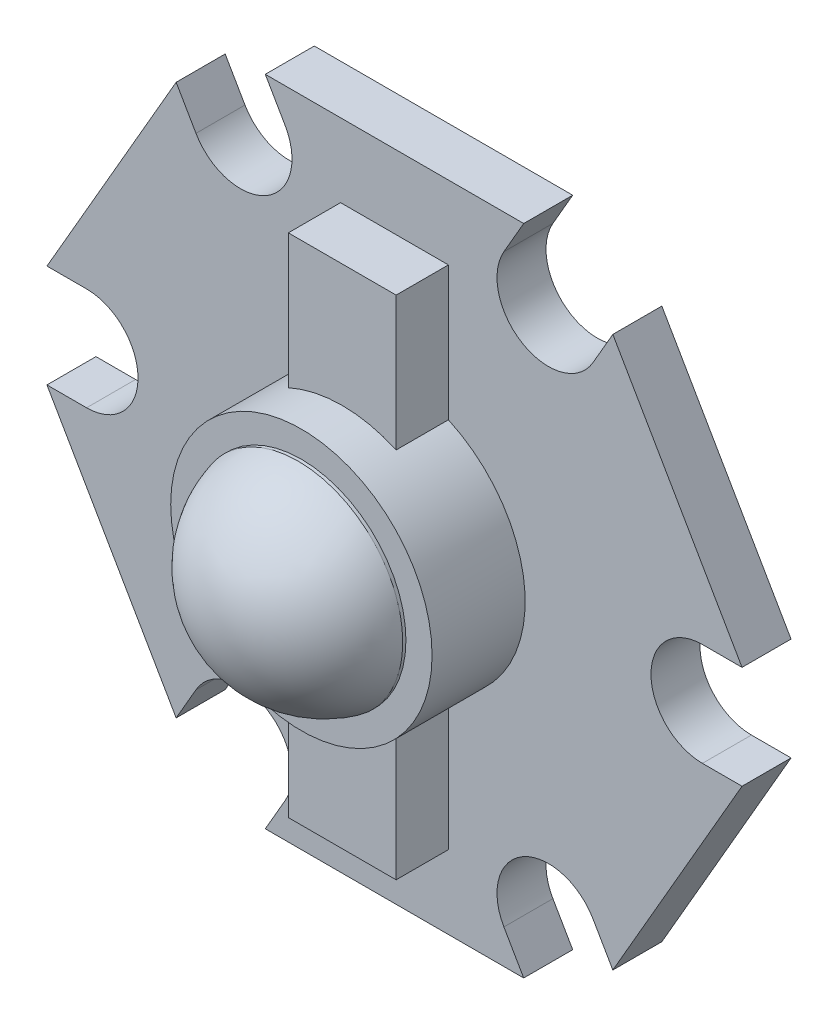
ISO-10303-21;
HEADER;
FILE_DESCRIPTION(('STEP AP214'),'2;1');
FILE_NAME('part.step','',(''),(''),'','','');
FILE_SCHEMA(('AUTOMOTIVE_DESIGN { 1 0 10303 214 1 1 1 1 }'));
ENDSEC;
DATA;
#1=APPLICATION_CONTEXT('core data for automotive mechanical design processes');
#2=APPLICATION_PROTOCOL_DEFINITION('international standard','automotive_design',2000,#1);
#3=PRODUCT_CONTEXT('',#1,'mechanical');
#4=PRODUCT('Part','Part','',(#3));
#5=PRODUCT_RELATED_PRODUCT_CATEGORY('part','',(#4));
#6=PRODUCT_DEFINITION_FORMATION('','',#4);
#7=PRODUCT_DEFINITION_CONTEXT('part definition',#1,'design');
#8=PRODUCT_DEFINITION('design','',#6,#7);
#9=PRODUCT_DEFINITION_SHAPE('','',#8);
#10=(LENGTH_UNIT() NAMED_UNIT(*) SI_UNIT(.MILLI.,.METRE.));
#11=(NAMED_UNIT(*) PLANE_ANGLE_UNIT() SI_UNIT($,.RADIAN.));
#12=(NAMED_UNIT(*) SI_UNIT($,.STERADIAN.) SOLID_ANGLE_UNIT());
#13=UNCERTAINTY_MEASURE_WITH_UNIT(LENGTH_MEASURE(1.E-05),#10,'distance_accuracy_value','');
#14=(GEOMETRIC_REPRESENTATION_CONTEXT(3) GLOBAL_UNCERTAINTY_ASSIGNED_CONTEXT((#13)) GLOBAL_UNIT_ASSIGNED_CONTEXT((#10,
#11,#12)) REPRESENTATION_CONTEXT('',''));
#15=CARTESIAN_POINT('',(0.,0.,0.));
#16=DIRECTION('',(0.,0.,1.));
#17=DIRECTION('',(1.,0.,0.));
#18=AXIS2_PLACEMENT_3D('',#15,#16,#17);
#19=CARTESIAN_POINT('',(0.,0.,3.652));
#20=DIRECTION('',(1.,0.,0.));
#21=DIRECTION('',(0.,0.,-1.));
#22=AXIS2_PLACEMENT_3D('',#19,#20,#21);
#23=SPHERICAL_SURFACE('',#22,3.298);
#24=CARTESIAN_POINT('',(0.,0.,4.45));
#25=DIRECTION('',(0.,0.,-1.));
#26=DIRECTION('',(-1.,0.,0.));
#27=AXIS2_PLACEMENT_3D('',#24,#25,#26);
#28=CIRCLE('',#27,3.2);
#29=CARTESIAN_POINT('',(-3.2,0.,4.45));
#30=VERTEX_POINT('',#29);
#31=EDGE_CURVE('E21',#30,#30,#28,.T.);
#32=ORIENTED_EDGE('',*,*,#31,.F.);
#33=EDGE_LOOP('',(#32));
#34=FACE_BOUND('',#33,.T.);
#35=ADVANCED_FACE('F17',(#34),#23,.T.);
#36=CARTESIAN_POINT('',(0.,0.,4.45));
#37=DIRECTION('',(0.,0.,-1.));
#38=DIRECTION('',(-1.,0.,0.));
#39=AXIS2_PLACEMENT_3D('',#36,#37,#38);
#40=CYLINDRICAL_SURFACE('',#39,3.2);
#41=CARTESIAN_POINT('',(0.,0.,4.35));
#42=DIRECTION('',(0.,0.,-1.));
#43=DIRECTION('',(-1.,0.,0.));
#44=AXIS2_PLACEMENT_3D('',#41,#42,#43);
#45=CIRCLE('',#44,3.2);
#46=CARTESIAN_POINT('',(-3.2,0.,4.35));
#47=VERTEX_POINT('',#46);
#48=EDGE_CURVE('E260',#47,#47,#45,.T.);
#49=ORIENTED_EDGE('',*,*,#48,.F.);
#50=EDGE_LOOP('',(#49));
#51=FACE_BOUND('',#50,.T.);
#52=ORIENTED_EDGE('',*,*,#31,.T.);
#53=EDGE_LOOP('',(#52));
#54=FACE_BOUND('',#53,.T.);
#55=ADVANCED_FACE('F268',(#51,#54),#40,.T.);
#56=CARTESIAN_POINT('',(0.,0.,3.1));
#57=DIRECTION('',(0.,0.,1.));
#58=DIRECTION('',(1.,0.,0.));
#59=AXIS2_PLACEMENT_3D('',#56,#57,#58);
#60=PLANE('',#59);
#61=DIRECTION('',(1.,0.,0.));
#62=VECTOR('',#61,1.);
#63=CARTESIAN_POINT('',(-1.65,7.75,3.1));
#64=LINE('',#63,#62);
#65=CARTESIAN_POINT('',(1.65,7.75,3.1));
#66=VERTEX_POINT('',#65);
#67=CARTESIAN_POINT('',(-1.65,7.75,3.1));
#68=VERTEX_POINT('',#67);
#69=EDGE_CURVE('E236',#66,#68,#64,.F.);
#70=ORIENTED_EDGE('',*,*,#69,.T.);
#71=DIRECTION('',(0.,1.,0.));
#72=VECTOR('',#71,1.);
#73=CARTESIAN_POINT('',(-1.65,7.75,3.1));
#74=LINE('',#73,#72);
#75=CARTESIAN_POINT('',(-1.65,3.64383040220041,3.1));
#76=VERTEX_POINT('',#75);
#77=EDGE_CURVE('E229',#68,#76,#74,.F.);
#78=ORIENTED_EDGE('',*,*,#77,.T.);
#79=CARTESIAN_POINT('',(0.,0.,3.1));
#80=DIRECTION('',(0.,0.,-1.));
#81=DIRECTION('',(-1.,0.,0.));
#82=AXIS2_PLACEMENT_3D('',#79,#80,#81);
#83=CIRCLE('',#82,4.);
#84=CARTESIAN_POINT('',(1.65,3.64383040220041,3.1));
#85=VERTEX_POINT('',#84);
#86=EDGE_CURVE('E233',#85,#76,#83,.F.);
#87=ORIENTED_EDGE('',*,*,#86,.F.);
#88=DIRECTION('',(0.,-1.,0.));
#89=VECTOR('',#88,1.);
#90=CARTESIAN_POINT('',(1.65,7.75,3.1));
#91=LINE('',#90,#89);
#92=EDGE_CURVE('E224',#85,#66,#91,.F.);
#93=ORIENTED_EDGE('',*,*,#92,.T.);
#94=EDGE_LOOP('',(#70,#78,#87,#93));
#95=FACE_BOUND('',#94,.T.);
#96=ADVANCED_FACE('F231',(#95),#60,.T.);
#97=CARTESIAN_POINT('',(0.,0.,4.35));
#98=DIRECTION('',(0.,0.,1.));
#99=DIRECTION('',(1.,0.,0.));
#100=AXIS2_PLACEMENT_3D('',#97,#98,#99);
#101=PLANE('',#100);
#102=ORIENTED_EDGE('',*,*,#48,.T.);
#103=EDGE_LOOP('',(#102));
#104=FACE_BOUND('',#103,.T.);
#105=CARTESIAN_POINT('',(0.,0.,4.35));
#106=DIRECTION('',(0.,0.,-1.));
#107=DIRECTION('',(-1.,0.,0.));
#108=AXIS2_PLACEMENT_3D('',#105,#106,#107);
#109=CIRCLE('',#108,4.);
#110=CARTESIAN_POINT('',(-4.,0.,4.35));
#111=VERTEX_POINT('',#110);
#112=EDGE_CURVE('E250',#111,#111,#109,.T.);
#113=ORIENTED_EDGE('',*,*,#112,.F.);
#114=EDGE_LOOP('',(#113));
#115=FACE_BOUND('',#114,.T.);
#116=ADVANCED_FACE('F409',(#104,#115),#101,.T.);
#117=CARTESIAN_POINT('',(0.,0.,3.1));
#118=DIRECTION('',(0.,0.,1.));
#119=DIRECTION('',(1.,0.,0.));
#120=AXIS2_PLACEMENT_3D('',#117,#118,#119);
#121=PLANE('',#120);
#122=DIRECTION('',(0.,1.,0.));
#123=VECTOR('',#122,1.);
#124=CARTESIAN_POINT('',(-1.65,-3.64383040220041,3.1));
#125=LINE('',#124,#123);
#126=CARTESIAN_POINT('',(-1.65,-3.64383040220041,3.1));
#127=VERTEX_POINT('',#126);
#128=CARTESIAN_POINT('',(-1.65,-7.75,3.1));
#129=VERTEX_POINT('',#128);
#130=EDGE_CURVE('E731',#127,#129,#125,.F.);
#131=ORIENTED_EDGE('',*,*,#130,.T.);
#132=DIRECTION('',(1.,0.,0.));
#133=VECTOR('',#132,1.);
#134=CARTESIAN_POINT('',(-1.65,-7.75,3.1));
#135=LINE('',#134,#133);
#136=CARTESIAN_POINT('',(1.65,-7.75,3.1));
#137=VERTEX_POINT('',#136);
#138=EDGE_CURVE('E812',#129,#137,#135,.T.);
#139=ORIENTED_EDGE('',*,*,#138,.T.);
#140=DIRECTION('',(0.,-1.,0.));
#141=VECTOR('',#140,1.);
#142=CARTESIAN_POINT('',(1.65,-3.64383040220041,3.1));
#143=LINE('',#142,#141);
#144=CARTESIAN_POINT('',(1.65,-3.64383040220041,3.1));
#145=VERTEX_POINT('',#144);
#146=EDGE_CURVE('E806',#137,#145,#143,.F.);
#147=ORIENTED_EDGE('',*,*,#146,.T.);
#148=CARTESIAN_POINT('',(0.,0.,3.1));
#149=DIRECTION('',(0.,0.,-1.));
#150=DIRECTION('',(-1.,0.,0.));
#151=AXIS2_PLACEMENT_3D('',#148,#149,#150);
#152=CIRCLE('',#151,4.);
#153=EDGE_CURVE('E729',#127,#145,#152,.F.);
#154=ORIENTED_EDGE('',*,*,#153,.F.);
#155=EDGE_LOOP('',(#131,#139,#147,#154));
#156=FACE_BOUND('',#155,.T.);
#157=ADVANCED_FACE('F406',(#156),#121,.T.);
#158=CARTESIAN_POINT('',(1.65,7.75,3.1));
#159=DIRECTION('',(-1.,0.,0.));
#160=DIRECTION('',(0.,-1.,0.));
#161=AXIS2_PLACEMENT_3D('',#158,#159,#160);
#162=PLANE('',#161);
#163=DIRECTION('',(0.,1.,0.));
#164=VECTOR('',#163,1.);
#165=CARTESIAN_POINT('',(1.65,8.16228943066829,1.5));
#166=LINE('',#165,#164);
#167=CARTESIAN_POINT('',(1.65,3.64383040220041,1.5));
#168=VERTEX_POINT('',#167);
#169=CARTESIAN_POINT('',(1.65,7.75,1.5));
#170=VERTEX_POINT('',#169);
#171=EDGE_CURVE('E739',#168,#170,#166,.T.);
#172=ORIENTED_EDGE('',*,*,#171,.T.);
#173=DIRECTION('',(0.,0.,1.));
#174=VECTOR('',#173,1.);
#175=CARTESIAN_POINT('',(1.65,7.75,3.1));
#176=LINE('',#175,#174);
#177=EDGE_CURVE('E241',#170,#66,#176,.T.);
#178=ORIENTED_EDGE('',*,*,#177,.T.);
#179=ORIENTED_EDGE('',*,*,#92,.F.);
#180=DIRECTION('',(0.,0.,-1.));
#181=VECTOR('',#180,1.);
#182=CARTESIAN_POINT('',(1.65,3.64383040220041,4.35));
#183=LINE('',#182,#181);
#184=EDGE_CURVE('E255',#168,#85,#183,.F.);
#185=ORIENTED_EDGE('',*,*,#184,.F.);
#186=EDGE_LOOP('',(#172,#178,#179,#185));
#187=FACE_BOUND('',#186,.T.);
#188=ADVANCED_FACE('F402',(#187),#162,.F.);
#189=CARTESIAN_POINT('',(-1.65,7.75,3.1));
#190=DIRECTION('',(0.,-1.,0.));
#191=DIRECTION('',(1.,0.,0.));
#192=AXIS2_PLACEMENT_3D('',#189,#190,#191);
#193=PLANE('',#192);
#194=DIRECTION('',(-1.,0.,0.));
#195=VECTOR('',#194,1.);
#196=CARTESIAN_POINT('',(-4.71250000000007,7.75,1.5));
#197=LINE('',#196,#195);
#198=CARTESIAN_POINT('',(-1.65,7.75,1.5));
#199=VERTEX_POINT('',#198);
#200=EDGE_CURVE('E819',#170,#199,#197,.T.);
#201=ORIENTED_EDGE('',*,*,#200,.T.);
#202=DIRECTION('',(0.,0.,1.));
#203=VECTOR('',#202,1.);
#204=CARTESIAN_POINT('',(-1.65,7.75,3.1));
#205=LINE('',#204,#203);
#206=EDGE_CURVE('E240',#199,#68,#205,.T.);
#207=ORIENTED_EDGE('',*,*,#206,.T.);
#208=ORIENTED_EDGE('',*,*,#69,.F.);
#209=ORIENTED_EDGE('',*,*,#177,.F.);
#210=EDGE_LOOP('',(#201,#207,#208,#209));
#211=FACE_BOUND('',#210,.T.);
#212=ADVANCED_FACE('F399',(#211),#193,.F.);
#213=CARTESIAN_POINT('',(-1.65,7.75,3.1));
#214=DIRECTION('',(1.,0.,0.));
#215=DIRECTION('',(0.,1.,0.));
#216=AXIS2_PLACEMENT_3D('',#213,#214,#215);
#217=PLANE('',#216);
#218=DIRECTION('',(0.,1.,0.));
#219=VECTOR('',#218,1.);
#220=CARTESIAN_POINT('',(-1.65,8.16228943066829,1.5));
#221=LINE('',#220,#219);
#222=CARTESIAN_POINT('',(-1.65,3.64383040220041,1.5));
#223=VERTEX_POINT('',#222);
#224=EDGE_CURVE('E248',#199,#223,#221,.F.);
#225=ORIENTED_EDGE('',*,*,#224,.T.);
#226=DIRECTION('',(0.,0.,-1.));
#227=VECTOR('',#226,1.);
#228=CARTESIAN_POINT('',(-1.65,3.64383040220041,4.35));
#229=LINE('',#228,#227);
#230=EDGE_CURVE('E245',#76,#223,#229,.T.);
#231=ORIENTED_EDGE('',*,*,#230,.F.);
#232=ORIENTED_EDGE('',*,*,#77,.F.);
#233=ORIENTED_EDGE('',*,*,#206,.F.);
#234=EDGE_LOOP('',(#225,#231,#232,#233));
#235=FACE_BOUND('',#234,.T.);
#236=ADVANCED_FACE('F246',(#235),#217,.F.);
#237=CARTESIAN_POINT('',(0.,0.,4.35));
#238=DIRECTION('',(0.,0.,-1.));
#239=DIRECTION('',(-1.,0.,0.));
#240=AXIS2_PLACEMENT_3D('',#237,#238,#239);
#241=CYLINDRICAL_SURFACE('',#240,4.);
#242=ORIENTED_EDGE('',*,*,#112,.T.);
#243=EDGE_LOOP('',(#242));
#244=FACE_BOUND('',#243,.T.);
#245=DIRECTION('',(0.,0.,1.));
#246=VECTOR('',#245,1.);
#247=CARTESIAN_POINT('',(1.65,-3.64383040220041,3.1));
#248=LINE('',#247,#246);
#249=CARTESIAN_POINT('',(1.65,-3.64383040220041,1.5));
#250=VERTEX_POINT('',#249);
#251=EDGE_CURVE('E808',#145,#250,#248,.F.);
#252=ORIENTED_EDGE('',*,*,#251,.T.);
#253=CARTESIAN_POINT('',(0.,0.,1.5));
#254=DIRECTION('',(0.,0.,-1.));
#255=DIRECTION('',(-1.,0.,0.));
#256=AXIS2_PLACEMENT_3D('',#253,#254,#255);
#257=CIRCLE('',#256,4.);
#258=EDGE_CURVE('E737',#250,#168,#257,.F.);
#259=ORIENTED_EDGE('',*,*,#258,.T.);
#260=ORIENTED_EDGE('',*,*,#184,.T.);
#261=ORIENTED_EDGE('',*,*,#86,.T.);
#262=ORIENTED_EDGE('',*,*,#230,.T.);
#263=CARTESIAN_POINT('',(0.,0.,1.5));
#264=DIRECTION('',(0.,0.,-1.));
#265=DIRECTION('',(-1.,0.,0.));
#266=AXIS2_PLACEMENT_3D('',#263,#264,#265);
#267=CIRCLE('',#266,4.);
#268=CARTESIAN_POINT('',(-1.65,-3.64383040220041,1.5));
#269=VERTEX_POINT('',#268);
#270=EDGE_CURVE('E741',#223,#269,#267,.F.);
#271=ORIENTED_EDGE('',*,*,#270,.T.);
#272=DIRECTION('',(0.,0.,1.));
#273=VECTOR('',#272,1.);
#274=CARTESIAN_POINT('',(-1.65,-3.64383040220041,3.1));
#275=LINE('',#274,#273);
#276=EDGE_CURVE('E734',#269,#127,#275,.T.);
#277=ORIENTED_EDGE('',*,*,#276,.T.);
#278=ORIENTED_EDGE('',*,*,#153,.T.);
#279=EDGE_LOOP('',(#252,#259,#260,#261,#262,#271,#277,#278));
#280=FACE_BOUND('',#279,.T.);
#281=ADVANCED_FACE('F253',(#244,#280),#241,.T.);
#282=CARTESIAN_POINT('',(-1.65,-3.64383040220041,3.1));
#283=DIRECTION('',(1.,0.,0.));
#284=DIRECTION('',(0.,1.,0.));
#285=AXIS2_PLACEMENT_3D('',#282,#283,#284);
#286=PLANE('',#285);
#287=DIRECTION('',(0.,1.,0.));
#288=VECTOR('',#287,1.);
#289=CARTESIAN_POINT('',(-1.65,8.16228943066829,1.5));
#290=LINE('',#289,#288);
#291=CARTESIAN_POINT('',(-1.65,-7.75,1.5));
#292=VERTEX_POINT('',#291);
#293=EDGE_CURVE('E743',#269,#292,#290,.F.);
#294=ORIENTED_EDGE('',*,*,#293,.T.);
#295=DIRECTION('',(0.,0.,1.));
#296=VECTOR('',#295,1.);
#297=CARTESIAN_POINT('',(-1.65,-7.75,3.1));
#298=LINE('',#297,#296);
#299=EDGE_CURVE('E809',#292,#129,#298,.T.);
#300=ORIENTED_EDGE('',*,*,#299,.T.);
#301=ORIENTED_EDGE('',*,*,#130,.F.);
#302=ORIENTED_EDGE('',*,*,#276,.F.);
#303=EDGE_LOOP('',(#294,#300,#301,#302));
#304=FACE_BOUND('',#303,.T.);
#305=ADVANCED_FACE('F389',(#304),#286,.F.);
#306=CARTESIAN_POINT('',(-1.65,-7.75,3.1));
#307=DIRECTION('',(0.,1.,0.));
#308=DIRECTION('',(0.,0.,1.));
#309=AXIS2_PLACEMENT_3D('',#306,#307,#308);
#310=PLANE('',#309);
#311=DIRECTION('',(-1.,0.,0.));
#312=VECTOR('',#311,1.);
#313=CARTESIAN_POINT('',(-4.71250000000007,-7.75,1.5));
#314=LINE('',#313,#312);
#315=CARTESIAN_POINT('',(1.65,-7.75,1.5));
#316=VERTEX_POINT('',#315);
#317=EDGE_CURVE('E831',#292,#316,#314,.F.);
#318=ORIENTED_EDGE('',*,*,#317,.T.);
#319=DIRECTION('',(0.,0.,1.));
#320=VECTOR('',#319,1.);
#321=CARTESIAN_POINT('',(1.65,-7.75,3.1));
#322=LINE('',#321,#320);
#323=EDGE_CURVE('E740',#316,#137,#322,.T.);
#324=ORIENTED_EDGE('',*,*,#323,.T.);
#325=ORIENTED_EDGE('',*,*,#138,.F.);
#326=ORIENTED_EDGE('',*,*,#299,.F.);
#327=EDGE_LOOP('',(#318,#324,#325,#326));
#328=FACE_BOUND('',#327,.T.);
#329=ADVANCED_FACE('F385',(#328),#310,.F.);
#330=CARTESIAN_POINT('',(1.65,-3.64383040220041,3.1));
#331=DIRECTION('',(-1.,0.,0.));
#332=DIRECTION('',(0.,-1.,0.));
#333=AXIS2_PLACEMENT_3D('',#330,#331,#332);
#334=PLANE('',#333);
#335=DIRECTION('',(0.,1.,0.));
#336=VECTOR('',#335,1.);
#337=CARTESIAN_POINT('',(1.65,8.16228943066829,1.5));
#338=LINE('',#337,#336);
#339=EDGE_CURVE('E833',#316,#250,#338,.T.);
#340=ORIENTED_EDGE('',*,*,#339,.T.);
#341=ORIENTED_EDGE('',*,*,#251,.F.);
#342=ORIENTED_EDGE('',*,*,#146,.F.);
#343=ORIENTED_EDGE('',*,*,#323,.F.);
#344=EDGE_LOOP('',(#340,#341,#342,#343));
#345=FACE_BOUND('',#344,.T.);
#346=ADVANCED_FACE('F381',(#345),#334,.F.);
#347=CARTESIAN_POINT('',(-4.71250000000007,8.16228943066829,1.5));
#348=DIRECTION('',(0.,0.,-1.));
#349=DIRECTION('',(-1.,0.,0.));
#350=AXIS2_PLACEMENT_3D('',#347,#348,#349);
#351=PLANE('',#350);
#352=ORIENTED_EDGE('',*,*,#317,.F.);
#353=ORIENTED_EDGE('',*,*,#293,.F.);
#354=ORIENTED_EDGE('',*,*,#270,.F.);
#355=ORIENTED_EDGE('',*,*,#224,.F.);
#356=ORIENTED_EDGE('',*,*,#200,.F.);
#357=ORIENTED_EDGE('',*,*,#171,.F.);
#358=ORIENTED_EDGE('',*,*,#258,.F.);
#359=ORIENTED_EDGE('',*,*,#339,.F.);
#360=EDGE_LOOP('',(#352,#353,#354,#355,#356,#357,#358,#359));
#361=FACE_BOUND('',#360,.T.);
#362=DIRECTION('',(1.,0.,0.));
#363=VECTOR('',#362,1.);
#364=CARTESIAN_POINT('',(-3.95484934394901,10.,1.5));
#365=LINE('',#364,#363);
#366=CARTESIAN_POINT('',(3.95484934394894,10.,1.5));
#367=VERTEX_POINT('',#366);
#368=CARTESIAN_POINT('',(-3.95484934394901,10.,1.5));
#369=VERTEX_POINT('',#368);
#370=EDGE_CURVE('E927',#367,#369,#365,.F.);
#371=ORIENTED_EDGE('',*,*,#370,.T.);
#372=DIRECTION('',(-0.500000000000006,0.866025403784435,0.));
#373=VECTOR('',#372,1.);
#374=CARTESIAN_POINT('',(-3.34850998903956,8.94978943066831,1.5));
#375=LINE('',#374,#373);
#376=CARTESIAN_POINT('',(-3.34850998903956,8.94978943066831,1.5));
#377=VERTEX_POINT('',#376);
#378=EDGE_CURVE('E932',#369,#377,#375,.F.);
#379=ORIENTED_EDGE('',*,*,#378,.T.);
#380=CARTESIAN_POINT('',(-4.71250000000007,8.16228943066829,1.5));
#381=DIRECTION('',(0.,0.,-1.));
#382=DIRECTION('',(-1.,0.,0.));
#383=AXIS2_PLACEMENT_3D('',#380,#381,#382);
#384=CIRCLE('',#383,1.575);
#385=CARTESIAN_POINT('',(-6.07649001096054,7.37478943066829,1.5));
#386=VERTEX_POINT('',#385);
#387=EDGE_CURVE('E764',#377,#386,#384,.T.);
#388=ORIENTED_EDGE('',*,*,#387,.T.);
#389=DIRECTION('',(0.500000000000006,-0.866025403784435,0.));
#390=VECTOR('',#389,1.);
#391=CARTESIAN_POINT('',(-6.07649001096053,7.3747894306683,1.5));
#392=LINE('',#391,#390);
#393=CARTESIAN_POINT('',(-6.68282936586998,8.42499999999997,1.5));
#394=VERTEX_POINT('',#393);
#395=EDGE_CURVE('E906',#386,#394,#392,.F.);
#396=ORIENTED_EDGE('',*,*,#395,.T.);
#397=DIRECTION('',(0.499999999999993,0.866025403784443,0.));
#398=VECTOR('',#397,1.);
#399=CARTESIAN_POINT('',(-6.68282936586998,8.42499999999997,1.5));
#400=LINE('',#399,#398);
#401=CARTESIAN_POINT('',(-10.6376787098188,1.57500000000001,1.5));
#402=VERTEX_POINT('',#401);
#403=EDGE_CURVE('E901',#394,#402,#400,.F.);
#404=ORIENTED_EDGE('',*,*,#403,.T.);
#405=DIRECTION('',(-1.,0.,0.));
#406=VECTOR('',#405,1.);
#407=CARTESIAN_POINT('',(-9.42499999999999,1.575,1.5));
#408=LINE('',#407,#406);
#409=CARTESIAN_POINT('',(-9.42499999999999,1.575,1.5));
#410=VERTEX_POINT('',#409);
#411=EDGE_CURVE('E896',#402,#410,#408,.F.);
#412=ORIENTED_EDGE('',*,*,#411,.T.);
#413=CARTESIAN_POINT('',(-9.425,0.,1.5));
#414=DIRECTION('',(0.,0.,-1.));
#415=DIRECTION('',(-1.,0.,0.));
#416=AXIS2_PLACEMENT_3D('',#413,#414,#415);
#417=CIRCLE('',#416,1.575);
#418=CARTESIAN_POINT('',(-9.425,-1.57499999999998,1.5));
#419=VERTEX_POINT('',#418);
#420=EDGE_CURVE('E760',#410,#419,#417,.T.);
#421=ORIENTED_EDGE('',*,*,#420,.T.);
#422=DIRECTION('',(1.,0.,0.));
#423=VECTOR('',#422,1.);
#424=CARTESIAN_POINT('',(-9.425,-1.57499999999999,1.5));
#425=LINE('',#424,#423);
#426=CARTESIAN_POINT('',(-10.6376787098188,-1.57499999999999,1.5));
#427=VERTEX_POINT('',#426);
#428=EDGE_CURVE('E892',#419,#427,#425,.F.);
#429=ORIENTED_EDGE('',*,*,#428,.T.);
#430=DIRECTION('',(-0.499999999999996,0.866025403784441,0.));
#431=VECTOR('',#430,1.);
#432=CARTESIAN_POINT('',(-6.68282936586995,-8.42499999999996,1.5));
#433=LINE('',#432,#431);
#434=CARTESIAN_POINT('',(-6.68282936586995,-8.42499999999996,1.5));
#435=VERTEX_POINT('',#434);
#436=EDGE_CURVE('E887',#427,#435,#433,.F.);
#437=ORIENTED_EDGE('',*,*,#436,.T.);
#438=DIRECTION('',(-0.500000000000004,-0.866025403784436,0.));
#439=VECTOR('',#438,1.);
#440=CARTESIAN_POINT('',(-6.07649001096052,-7.3747894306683,1.5));
#441=LINE('',#440,#439);
#442=CARTESIAN_POINT('',(-6.07649001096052,-7.3747894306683,1.5));
#443=VERTEX_POINT('',#442);
#444=EDGE_CURVE('E882',#435,#443,#441,.F.);
#445=ORIENTED_EDGE('',*,*,#444,.T.);
#446=CARTESIAN_POINT('',(-4.71250000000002,-8.16228943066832,1.5));
#447=DIRECTION('',(0.,0.,-1.));
#448=DIRECTION('',(-1.,0.,0.));
#449=AXIS2_PLACEMENT_3D('',#446,#447,#448);
#450=CIRCLE('',#449,1.575);
#451=CARTESIAN_POINT('',(-3.34850998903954,-8.94978943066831,1.5));
#452=VERTEX_POINT('',#451);
#453=EDGE_CURVE('E756',#443,#452,#450,.T.);
#454=ORIENTED_EDGE('',*,*,#453,.T.);
#455=DIRECTION('',(0.500000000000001,0.866025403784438,0.));
#456=VECTOR('',#455,1.);
#457=CARTESIAN_POINT('',(-3.34850998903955,-8.94978943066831,1.5));
#458=LINE('',#457,#456);
#459=CARTESIAN_POINT('',(-3.95484934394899,-10.,1.5));
#460=VERTEX_POINT('',#459);
#461=EDGE_CURVE('E878',#452,#460,#458,.F.);
#462=ORIENTED_EDGE('',*,*,#461,.T.);
#463=DIRECTION('',(1.,0.,0.));
#464=VECTOR('',#463,1.);
#465=CARTESIAN_POINT('',(-3.95484934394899,-10.,1.5));
#466=LINE('',#465,#464);
#467=CARTESIAN_POINT('',(3.95484934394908,-10.,1.5));
#468=VERTEX_POINT('',#467);
#469=EDGE_CURVE('E873',#460,#468,#466,.T.);
#470=ORIENTED_EDGE('',*,*,#469,.T.);
#471=DIRECTION('',(0.500000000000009,-0.866025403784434,0.));
#472=VECTOR('',#471,1.);
#473=CARTESIAN_POINT('',(3.34850998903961,-8.94978943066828,1.5));
#474=LINE('',#473,#472);
#475=CARTESIAN_POINT('',(3.34850998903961,-8.94978943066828,1.5));
#476=VERTEX_POINT('',#475);
#477=EDGE_CURVE('E754',#468,#476,#474,.F.);
#478=ORIENTED_EDGE('',*,*,#477,.T.);
#479=CARTESIAN_POINT('',(4.71250000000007,-8.16228943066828,1.5));
#480=DIRECTION('',(0.,0.,-1.));
#481=DIRECTION('',(-1.,0.,0.));
#482=AXIS2_PLACEMENT_3D('',#479,#480,#481);
#483=CIRCLE('',#482,1.575);
#484=CARTESIAN_POINT('',(6.07649001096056,-7.37478943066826,1.5));
#485=VERTEX_POINT('',#484);
#486=EDGE_CURVE('E752',#476,#485,#483,.T.);
#487=ORIENTED_EDGE('',*,*,#486,.T.);
#488=DIRECTION('',(-0.500000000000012,0.866025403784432,0.));
#489=VECTOR('',#488,1.);
#490=CARTESIAN_POINT('',(6.07649001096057,-7.37478943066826,1.5));
#491=LINE('',#490,#489);
#492=CARTESIAN_POINT('',(6.68282936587,-8.42499999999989,1.5));
#493=VERTEX_POINT('',#492);
#494=EDGE_CURVE('E864',#485,#493,#491,.F.);
#495=ORIENTED_EDGE('',*,*,#494,.T.);
#496=DIRECTION('',(-0.499999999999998,-0.86602540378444,0.));
#497=VECTOR('',#496,1.);
#498=CARTESIAN_POINT('',(6.68282936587,-8.42499999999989,1.5));
#499=LINE('',#498,#497);
#500=CARTESIAN_POINT('',(10.6376787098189,-1.57499999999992,1.5));
#501=VERTEX_POINT('',#500);
#502=EDGE_CURVE('E859',#493,#501,#499,.F.);
#503=ORIENTED_EDGE('',*,*,#502,.T.);
#504=DIRECTION('',(1.,0.,0.));
#505=VECTOR('',#504,1.);
#506=CARTESIAN_POINT('',(9.42500000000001,-1.57499999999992,1.5));
#507=LINE('',#506,#505);
#508=CARTESIAN_POINT('',(9.42500000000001,-1.57499999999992,1.5));
#509=VERTEX_POINT('',#508);
#510=EDGE_CURVE('E750',#501,#509,#507,.F.);
#511=ORIENTED_EDGE('',*,*,#510,.T.);
#512=CARTESIAN_POINT('',(9.425,0.,1.5));
#513=DIRECTION('',(0.,0.,-1.));
#514=DIRECTION('',(-1.,0.,0.));
#515=AXIS2_PLACEMENT_3D('',#512,#513,#514);
#516=CIRCLE('',#515,1.575);
#517=CARTESIAN_POINT('',(9.42500000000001,1.57500000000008,1.5));
#518=VERTEX_POINT('',#517);
#519=EDGE_CURVE('E748',#509,#518,#516,.T.);
#520=ORIENTED_EDGE('',*,*,#519,.T.);
#521=DIRECTION('',(-1.,0.,0.));
#522=VECTOR('',#521,1.);
#523=CARTESIAN_POINT('',(9.42499999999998,1.57500000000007,1.5));
#524=LINE('',#523,#522);
#525=CARTESIAN_POINT('',(10.6376787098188,1.57500000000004,1.5));
#526=VERTEX_POINT('',#525);
#527=EDGE_CURVE('E850',#518,#526,#524,.F.);
#528=ORIENTED_EDGE('',*,*,#527,.T.);
#529=DIRECTION('',(0.499999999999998,-0.86602540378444,0.));
#530=VECTOR('',#529,1.);
#531=CARTESIAN_POINT('',(6.68282936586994,8.425,1.5));
#532=LINE('',#531,#530);
#533=CARTESIAN_POINT('',(6.68282936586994,8.425,1.5));
#534=VERTEX_POINT('',#533);
#535=EDGE_CURVE('E845',#526,#534,#532,.F.);
#536=ORIENTED_EDGE('',*,*,#535,.T.);
#537=DIRECTION('',(0.499999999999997,0.86602540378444,0.));
#538=VECTOR('',#537,1.);
#539=CARTESIAN_POINT('',(6.07649001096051,7.37478943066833,1.5));
#540=LINE('',#539,#538);
#541=CARTESIAN_POINT('',(6.07649001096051,7.37478943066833,1.5));
#542=VERTEX_POINT('',#541);
#543=EDGE_CURVE('E746',#534,#542,#540,.F.);
#544=ORIENTED_EDGE('',*,*,#543,.T.);
#545=CARTESIAN_POINT('',(4.71250000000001,8.16228943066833,1.5));
#546=DIRECTION('',(0.,0.,-1.));
#547=DIRECTION('',(-1.,0.,0.));
#548=AXIS2_PLACEMENT_3D('',#545,#546,#547);
#549=CIRCLE('',#548,1.57500000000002);
#550=CARTESIAN_POINT('',(3.34850998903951,8.94978943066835,1.5));
#551=VERTEX_POINT('',#550);
#552=EDGE_CURVE('E744',#542,#551,#549,.T.);
#553=ORIENTED_EDGE('',*,*,#552,.T.);
#554=DIRECTION('',(-0.500000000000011,-0.866025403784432,0.));
#555=VECTOR('',#554,1.);
#556=CARTESIAN_POINT('',(3.3485099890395,8.94978943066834,1.5));
#557=LINE('',#556,#555);
#558=EDGE_CURVE('E910',#551,#367,#557,.F.);
#559=ORIENTED_EDGE('',*,*,#558,.T.);
#560=EDGE_LOOP('',(#371,#379,#388,#396,#404,#412,#421,#429,#437,#445,#454,#462,#470,#478,#487,
#495,#503,#511,#520,#528,#536,#544,#553,#559));
#561=FACE_BOUND('',#560,.T.);
#562=ADVANCED_FACE('F377',(#361,#561),#351,.F.);
#563=CARTESIAN_POINT('',(3.3485099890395,8.94978943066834,1.5));
#564=DIRECTION('',(-0.866025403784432,0.500000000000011,0.));
#565=DIRECTION('',(-0.500000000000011,-0.866025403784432,0.));
#566=AXIS2_PLACEMENT_3D('',#563,#564,#565);
#567=PLANE('',#566);
#568=DIRECTION('',(0.,0.,1.));
#569=VECTOR('',#568,1.);
#570=CARTESIAN_POINT('',(3.95484934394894,10.,1.5));
#571=LINE('',#570,#569);
#572=CARTESIAN_POINT('',(3.95484934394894,10.,0.));
#573=VERTEX_POINT('',#572);
#574=EDGE_CURVE('E929',#573,#367,#571,.T.);
#575=ORIENTED_EDGE('',*,*,#574,.T.);
#576=ORIENTED_EDGE('',*,*,#558,.F.);
#577=DIRECTION('',(0.,0.,-1.));
#578=VECTOR('',#577,1.);
#579=CARTESIAN_POINT('',(3.3485099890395,8.94978943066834,1.5));
#580=LINE('',#579,#578);
#581=CARTESIAN_POINT('',(3.34850998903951,8.94978943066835,0.));
#582=VERTEX_POINT('',#581);
#583=EDGE_CURVE('E747',#551,#582,#580,.T.);
#584=ORIENTED_EDGE('',*,*,#583,.T.);
#585=DIRECTION('',(-0.50000000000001,-0.866025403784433,0.));
#586=VECTOR('',#585,1.);
#587=CARTESIAN_POINT('',(3.95484934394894,10.,0.));
#588=LINE('',#587,#586);
#589=EDGE_CURVE('E771',#573,#582,#588,.T.);
#590=ORIENTED_EDGE('',*,*,#589,.F.);
#591=EDGE_LOOP('',(#575,#576,#584,#590));
#592=FACE_BOUND('',#591,.T.);
#593=ADVANCED_FACE('F373',(#592),#567,.F.);
#594=CARTESIAN_POINT('',(4.71250000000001,8.16228943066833,1.5));
#595=DIRECTION('',(0.,0.,-1.));
#596=DIRECTION('',(-1.,0.,0.));
#597=AXIS2_PLACEMENT_3D('',#594,#595,#596);
#598=CYLINDRICAL_SURFACE('',#597,1.57500000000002);
#599=ORIENTED_EDGE('',*,*,#552,.F.);
#600=DIRECTION('',(0.,0.,1.));
#601=VECTOR('',#600,1.);
#602=CARTESIAN_POINT('',(6.07649001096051,7.37478943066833,1.5));
#603=LINE('',#602,#601);
#604=CARTESIAN_POINT('',(6.07649001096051,7.37478943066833,0.));
#605=VERTEX_POINT('',#604);
#606=EDGE_CURVE('E842',#542,#605,#603,.F.);
#607=ORIENTED_EDGE('',*,*,#606,.T.);
#608=CARTESIAN_POINT('',(4.71250000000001,8.16228943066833,0.));
#609=DIRECTION('',(0.,0.,-1.));
#610=DIRECTION('',(-1.,0.,0.));
#611=AXIS2_PLACEMENT_3D('',#608,#609,#610);
#612=CIRCLE('',#611,1.57500000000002);
#613=EDGE_CURVE('E768',#582,#605,#612,.F.);
#614=ORIENTED_EDGE('',*,*,#613,.F.);
#615=ORIENTED_EDGE('',*,*,#583,.F.);
#616=EDGE_LOOP('',(#599,#607,#614,#615));
#617=FACE_BOUND('',#616,.T.);
#618=ADVANCED_FACE('F369',(#617),#598,.F.);
#619=CARTESIAN_POINT('',(6.07649001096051,7.37478943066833,1.5));
#620=DIRECTION('',(0.86602540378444,-0.499999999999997,0.));
#621=DIRECTION('',(0.499999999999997,0.86602540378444,0.));
#622=AXIS2_PLACEMENT_3D('',#619,#620,#621);
#623=PLANE('',#622);
#624=ORIENTED_EDGE('',*,*,#606,.F.);
#625=ORIENTED_EDGE('',*,*,#543,.F.);
#626=DIRECTION('',(0.,0.,1.));
#627=VECTOR('',#626,1.);
#628=CARTESIAN_POINT('',(6.68282936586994,8.425,1.5));
#629=LINE('',#628,#627);
#630=CARTESIAN_POINT('',(6.68282936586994,8.425,0.));
#631=VERTEX_POINT('',#630);
#632=EDGE_CURVE('E847',#534,#631,#629,.F.);
#633=ORIENTED_EDGE('',*,*,#632,.T.);
#634=DIRECTION('',(0.499999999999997,0.86602540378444,0.));
#635=VECTOR('',#634,1.);
#636=CARTESIAN_POINT('',(6.07649001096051,7.37478943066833,0.));
#637=LINE('',#636,#635);
#638=EDGE_CURVE('E770',#605,#631,#637,.T.);
#639=ORIENTED_EDGE('',*,*,#638,.F.);
#640=EDGE_LOOP('',(#624,#625,#633,#639));
#641=FACE_BOUND('',#640,.T.);
#642=ADVANCED_FACE('F365',(#641),#623,.F.);
#643=CARTESIAN_POINT('',(6.68282936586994,8.425,1.5));
#644=DIRECTION('',(-0.86602540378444,-0.499999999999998,0.));
#645=DIRECTION('',(0.499999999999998,-0.86602540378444,0.));
#646=AXIS2_PLACEMENT_3D('',#643,#644,#645);
#647=PLANE('',#646);
#648=ORIENTED_EDGE('',*,*,#632,.F.);
#649=ORIENTED_EDGE('',*,*,#535,.F.);
#650=DIRECTION('',(0.,0.,1.));
#651=VECTOR('',#650,1.);
#652=CARTESIAN_POINT('',(10.6376787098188,1.57500000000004,1.5));
#653=LINE('',#652,#651);
#654=CARTESIAN_POINT('',(10.6376787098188,1.57500000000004,0.));
#655=VERTEX_POINT('',#654);
#656=EDGE_CURVE('E852',#526,#655,#653,.F.);
#657=ORIENTED_EDGE('',*,*,#656,.T.);
#658=DIRECTION('',(0.499999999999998,-0.86602540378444,0.));
#659=VECTOR('',#658,1.);
#660=CARTESIAN_POINT('',(6.68282936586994,8.425,0.));
#661=LINE('',#660,#659);
#662=EDGE_CURVE('E947',#631,#655,#661,.T.);
#663=ORIENTED_EDGE('',*,*,#662,.F.);
#664=EDGE_LOOP('',(#648,#649,#657,#663));
#665=FACE_BOUND('',#664,.T.);
#666=ADVANCED_FACE('F361',(#665),#647,.F.);
#667=CARTESIAN_POINT('',(9.42499999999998,1.57500000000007,1.5));
#668=DIRECTION('',(0.,1.,0.));
#669=DIRECTION('',(-1.,0.,0.));
#670=AXIS2_PLACEMENT_3D('',#667,#668,#669);
#671=PLANE('',#670);
#672=ORIENTED_EDGE('',*,*,#656,.F.);
#673=ORIENTED_EDGE('',*,*,#527,.F.);
#674=DIRECTION('',(0.,0.,-1.));
#675=VECTOR('',#674,1.);
#676=CARTESIAN_POINT('',(9.42499999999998,1.57500000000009,1.5));
#677=LINE('',#676,#675);
#678=CARTESIAN_POINT('',(9.42499999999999,1.57500000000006,0.));
#679=VERTEX_POINT('',#678);
#680=EDGE_CURVE('E751',#518,#679,#677,.T.);
#681=ORIENTED_EDGE('',*,*,#680,.T.);
#682=DIRECTION('',(-1.,0.,0.));
#683=VECTOR('',#682,1.);
#684=CARTESIAN_POINT('',(-4.71250000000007,1.57500000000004,0.));
#685=LINE('',#684,#683);
#686=EDGE_CURVE('E775',#655,#679,#685,.T.);
#687=ORIENTED_EDGE('',*,*,#686,.F.);
#688=EDGE_LOOP('',(#672,#673,#681,#687));
#689=FACE_BOUND('',#688,.T.);
#690=ADVANCED_FACE('F357',(#689),#671,.F.);
#691=CARTESIAN_POINT('',(9.425,0.,1.5));
#692=DIRECTION('',(0.,0.,-1.));
#693=DIRECTION('',(-1.,0.,0.));
#694=AXIS2_PLACEMENT_3D('',#691,#692,#693);
#695=CYLINDRICAL_SURFACE('',#694,1.575);
#696=ORIENTED_EDGE('',*,*,#519,.F.);
#697=DIRECTION('',(0.,0.,1.));
#698=VECTOR('',#697,1.);
#699=CARTESIAN_POINT('',(9.42500000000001,-1.57499999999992,1.5));
#700=LINE('',#699,#698);
#701=CARTESIAN_POINT('',(9.425,-1.57499999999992,0.));
#702=VERTEX_POINT('',#701);
#703=EDGE_CURVE('E856',#509,#702,#700,.F.);
#704=ORIENTED_EDGE('',*,*,#703,.T.);
#705=CARTESIAN_POINT('',(9.425,0.,0.));
#706=DIRECTION('',(0.,0.,-1.));
#707=DIRECTION('',(-1.,0.,0.));
#708=AXIS2_PLACEMENT_3D('',#705,#706,#707);
#709=CIRCLE('',#708,1.575);
#710=EDGE_CURVE('E772',#679,#702,#709,.F.);
#711=ORIENTED_EDGE('',*,*,#710,.F.);
#712=ORIENTED_EDGE('',*,*,#680,.F.);
#713=EDGE_LOOP('',(#696,#704,#711,#712));
#714=FACE_BOUND('',#713,.T.);
#715=ADVANCED_FACE('F353',(#714),#695,.F.);
#716=CARTESIAN_POINT('',(9.42500000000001,-1.57499999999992,1.5));
#717=DIRECTION('',(0.,-1.,0.));
#718=DIRECTION('',(1.,0.,0.));
#719=AXIS2_PLACEMENT_3D('',#716,#717,#718);
#720=PLANE('',#719);
#721=ORIENTED_EDGE('',*,*,#703,.F.);
#722=ORIENTED_EDGE('',*,*,#510,.F.);
#723=DIRECTION('',(0.,0.,1.));
#724=VECTOR('',#723,1.);
#725=CARTESIAN_POINT('',(10.6376787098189,-1.57499999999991,1.5));
#726=LINE('',#725,#724);
#727=CARTESIAN_POINT('',(10.6376787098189,-1.57499999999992,0.));
#728=VERTEX_POINT('',#727);
#729=EDGE_CURVE('E861',#501,#728,#726,.F.);
#730=ORIENTED_EDGE('',*,*,#729,.T.);
#731=DIRECTION('',(-1.,0.,0.));
#732=VECTOR('',#731,1.);
#733=CARTESIAN_POINT('',(-4.71250000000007,-1.57499999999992,0.));
#734=LINE('',#733,#732);
#735=EDGE_CURVE('E774',#702,#728,#734,.F.);
#736=ORIENTED_EDGE('',*,*,#735,.F.);
#737=EDGE_LOOP('',(#721,#722,#730,#736));
#738=FACE_BOUND('',#737,.T.);
#739=ADVANCED_FACE('F349',(#738),#720,.F.);
#740=CARTESIAN_POINT('',(6.68282936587,-8.42499999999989,1.5));
#741=DIRECTION('',(-0.86602540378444,0.499999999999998,0.));
#742=DIRECTION('',(-0.499999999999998,-0.86602540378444,0.));
#743=AXIS2_PLACEMENT_3D('',#740,#741,#742);
#744=PLANE('',#743);
#745=ORIENTED_EDGE('',*,*,#729,.F.);
#746=ORIENTED_EDGE('',*,*,#502,.F.);
#747=DIRECTION('',(0.,0.,1.));
#748=VECTOR('',#747,1.);
#749=CARTESIAN_POINT('',(6.68282936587,-8.42499999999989,1.5));
#750=LINE('',#749,#748);
#751=CARTESIAN_POINT('',(6.68282936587,-8.42499999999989,0.));
#752=VERTEX_POINT('',#751);
#753=EDGE_CURVE('E866',#493,#752,#750,.F.);
#754=ORIENTED_EDGE('',*,*,#753,.T.);
#755=DIRECTION('',(-0.499999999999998,-0.86602540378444,0.));
#756=VECTOR('',#755,1.);
#757=CARTESIAN_POINT('',(10.6376787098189,-1.57499999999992,0.));
#758=LINE('',#757,#756);
#759=EDGE_CURVE('E961',#728,#752,#758,.T.);
#760=ORIENTED_EDGE('',*,*,#759,.F.);
#761=EDGE_LOOP('',(#745,#746,#754,#760));
#762=FACE_BOUND('',#761,.T.);
#763=ADVANCED_FACE('F345',(#762),#744,.F.);
#764=CARTESIAN_POINT('',(6.07649001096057,-7.37478943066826,1.5));
#765=DIRECTION('',(0.866025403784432,0.500000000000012,0.));
#766=DIRECTION('',(-0.500000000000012,0.866025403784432,0.));
#767=AXIS2_PLACEMENT_3D('',#764,#765,#766);
#768=PLANE('',#767);
#769=ORIENTED_EDGE('',*,*,#753,.F.);
#770=ORIENTED_EDGE('',*,*,#494,.F.);
#771=DIRECTION('',(0.,0.,-1.));
#772=VECTOR('',#771,1.);
#773=CARTESIAN_POINT('',(6.07649001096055,-7.37478943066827,1.5));
#774=LINE('',#773,#772);
#775=CARTESIAN_POINT('',(6.07649001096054,-7.37478943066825,0.));
#776=VERTEX_POINT('',#775);
#777=EDGE_CURVE('E755',#485,#776,#774,.T.);
#778=ORIENTED_EDGE('',*,*,#777,.T.);
#779=DIRECTION('',(-0.500000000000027,0.866025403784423,0.));
#780=VECTOR('',#779,1.);
#781=CARTESIAN_POINT('',(6.68282936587,-8.42499999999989,0.));
#782=LINE('',#781,#780);
#783=EDGE_CURVE('E779',#752,#776,#782,.T.);
#784=ORIENTED_EDGE('',*,*,#783,.F.);
#785=EDGE_LOOP('',(#769,#770,#778,#784));
#786=FACE_BOUND('',#785,.T.);
#787=ADVANCED_FACE('F341',(#786),#768,.F.);
#788=CARTESIAN_POINT('',(4.71250000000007,-8.16228943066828,1.5));
#789=DIRECTION('',(0.,0.,-1.));
#790=DIRECTION('',(-1.,0.,0.));
#791=AXIS2_PLACEMENT_3D('',#788,#789,#790);
#792=CYLINDRICAL_SURFACE('',#791,1.575);
#793=ORIENTED_EDGE('',*,*,#486,.F.);
#794=DIRECTION('',(0.,0.,1.));
#795=VECTOR('',#794,1.);
#796=CARTESIAN_POINT('',(3.34850998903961,-8.94978943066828,1.5));
#797=LINE('',#796,#795);
#798=CARTESIAN_POINT('',(3.34850998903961,-8.94978943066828,0.));
#799=VERTEX_POINT('',#798);
#800=EDGE_CURVE('E870',#476,#799,#797,.F.);
#801=ORIENTED_EDGE('',*,*,#800,.T.);
#802=CARTESIAN_POINT('',(4.71250000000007,-8.16228943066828,0.));
#803=DIRECTION('',(0.,0.,-1.));
#804=DIRECTION('',(-1.,0.,0.));
#805=AXIS2_PLACEMENT_3D('',#802,#803,#804);
#806=CIRCLE('',#805,1.575);
#807=EDGE_CURVE('E776',#776,#799,#806,.F.);
#808=ORIENTED_EDGE('',*,*,#807,.F.);
#809=ORIENTED_EDGE('',*,*,#777,.F.);
#810=EDGE_LOOP('',(#793,#801,#808,#809));
#811=FACE_BOUND('',#810,.T.);
#812=ADVANCED_FACE('F337',(#811),#792,.F.);
#813=CARTESIAN_POINT('',(3.34850998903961,-8.94978943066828,1.5));
#814=DIRECTION('',(-0.866025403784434,-0.500000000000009,0.));
#815=DIRECTION('',(0.500000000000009,-0.866025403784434,0.));
#816=AXIS2_PLACEMENT_3D('',#813,#814,#815);
#817=PLANE('',#816);
#818=ORIENTED_EDGE('',*,*,#800,.F.);
#819=ORIENTED_EDGE('',*,*,#477,.F.);
#820=DIRECTION('',(0.,0.,1.));
#821=VECTOR('',#820,1.);
#822=CARTESIAN_POINT('',(3.95484934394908,-10.,1.5));
#823=LINE('',#822,#821);
#824=CARTESIAN_POINT('',(3.95484934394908,-10.,0.));
#825=VERTEX_POINT('',#824);
#826=EDGE_CURVE('E875',#468,#825,#823,.F.);
#827=ORIENTED_EDGE('',*,*,#826,.T.);
#828=DIRECTION('',(0.500000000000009,-0.866025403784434,0.));
#829=VECTOR('',#828,1.);
#830=CARTESIAN_POINT('',(3.34850998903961,-8.94978943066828,0.));
#831=LINE('',#830,#829);
#832=EDGE_CURVE('E778',#799,#825,#831,.T.);
#833=ORIENTED_EDGE('',*,*,#832,.F.);
#834=EDGE_LOOP('',(#818,#819,#827,#833));
#835=FACE_BOUND('',#834,.T.);
#836=ADVANCED_FACE('F333',(#835),#817,.F.);
#837=CARTESIAN_POINT('',(-3.95484934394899,-10.,1.5));
#838=DIRECTION('',(0.,1.,0.));
#839=DIRECTION('',(0.,0.,1.));
#840=AXIS2_PLACEMENT_3D('',#837,#838,#839);
#841=PLANE('',#840);
#842=ORIENTED_EDGE('',*,*,#826,.F.);
#843=ORIENTED_EDGE('',*,*,#469,.F.);
#844=DIRECTION('',(0.,0.,1.));
#845=VECTOR('',#844,1.);
#846=CARTESIAN_POINT('',(-3.95484934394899,-10.,1.5));
#847=LINE('',#846,#845);
#848=CARTESIAN_POINT('',(-3.95484934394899,-10.,0.));
#849=VERTEX_POINT('',#848);
#850=EDGE_CURVE('E759',#460,#849,#847,.F.);
#851=ORIENTED_EDGE('',*,*,#850,.T.);
#852=DIRECTION('',(-1.,0.,0.));
#853=VECTOR('',#852,1.);
#854=CARTESIAN_POINT('',(-4.71250000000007,-10.,0.));
#855=LINE('',#854,#853);
#856=EDGE_CURVE('E975',#825,#849,#855,.T.);
#857=ORIENTED_EDGE('',*,*,#856,.F.);
#858=EDGE_LOOP('',(#842,#843,#851,#857));
#859=FACE_BOUND('',#858,.T.);
#860=ADVANCED_FACE('F329',(#859),#841,.F.);
#861=CARTESIAN_POINT('',(-3.34850998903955,-8.94978943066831,1.5));
#862=DIRECTION('',(0.866025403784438,-0.500000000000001,0.));
#863=DIRECTION('',(0.500000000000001,0.866025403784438,0.));
#864=AXIS2_PLACEMENT_3D('',#861,#862,#863);
#865=PLANE('',#864);
#866=ORIENTED_EDGE('',*,*,#850,.F.);
#867=ORIENTED_EDGE('',*,*,#461,.F.);
#868=DIRECTION('',(0.,0.,-1.));
#869=VECTOR('',#868,1.);
#870=CARTESIAN_POINT('',(-3.34850998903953,-8.94978943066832,1.5));
#871=LINE('',#870,#869);
#872=CARTESIAN_POINT('',(-3.34850998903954,-8.94978943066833,0.));
#873=VERTEX_POINT('',#872);
#874=EDGE_CURVE('E758',#452,#873,#871,.T.);
#875=ORIENTED_EDGE('',*,*,#874,.T.);
#876=DIRECTION('',(0.500000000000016,0.866025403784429,0.));
#877=VECTOR('',#876,1.);
#878=CARTESIAN_POINT('',(-3.95484934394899,-10.,0.));
#879=LINE('',#878,#877);
#880=EDGE_CURVE('E784',#849,#873,#879,.T.);
#881=ORIENTED_EDGE('',*,*,#880,.F.);
#882=EDGE_LOOP('',(#866,#867,#875,#881));
#883=FACE_BOUND('',#882,.T.);
#884=ADVANCED_FACE('F325',(#883),#865,.F.);
#885=CARTESIAN_POINT('',(-4.71250000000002,-8.16228943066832,1.5));
#886=DIRECTION('',(0.,0.,-1.));
#887=DIRECTION('',(-1.,0.,0.));
#888=AXIS2_PLACEMENT_3D('',#885,#886,#887);
#889=CYLINDRICAL_SURFACE('',#888,1.575);
#890=ORIENTED_EDGE('',*,*,#874,.F.);
#891=ORIENTED_EDGE('',*,*,#453,.F.);
#892=DIRECTION('',(0.,0.,1.));
#893=VECTOR('',#892,1.);
#894=CARTESIAN_POINT('',(-6.07649001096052,-7.3747894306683,1.5));
#895=LINE('',#894,#893);
#896=CARTESIAN_POINT('',(-6.07649001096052,-7.3747894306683,0.));
#897=VERTEX_POINT('',#896);
#898=EDGE_CURVE('E884',#443,#897,#895,.F.);
#899=ORIENTED_EDGE('',*,*,#898,.T.);
#900=CARTESIAN_POINT('',(-4.71250000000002,-8.16228943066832,0.));
#901=DIRECTION('',(0.,0.,-1.));
#902=DIRECTION('',(-1.,0.,0.));
#903=AXIS2_PLACEMENT_3D('',#900,#901,#902);
#904=CIRCLE('',#903,1.575);
#905=EDGE_CURVE('E780',#873,#897,#904,.F.);
#906=ORIENTED_EDGE('',*,*,#905,.F.);
#907=EDGE_LOOP('',(#890,#891,#899,#906));
#908=FACE_BOUND('',#907,.T.);
#909=ADVANCED_FACE('F321',(#908),#889,.F.);
#910=CARTESIAN_POINT('',(-6.07649001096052,-7.3747894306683,1.5));
#911=DIRECTION('',(-0.866025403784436,0.500000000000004,0.));
#912=DIRECTION('',(-0.500000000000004,-0.866025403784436,0.));
#913=AXIS2_PLACEMENT_3D('',#910,#911,#912);
#914=PLANE('',#913);
#915=ORIENTED_EDGE('',*,*,#898,.F.);
#916=ORIENTED_EDGE('',*,*,#444,.F.);
#917=DIRECTION('',(0.,0.,1.));
#918=VECTOR('',#917,1.);
#919=CARTESIAN_POINT('',(-6.68282936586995,-8.42499999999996,1.5));
#920=LINE('',#919,#918);
#921=CARTESIAN_POINT('',(-6.68282936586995,-8.42499999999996,0.));
#922=VERTEX_POINT('',#921);
#923=EDGE_CURVE('E889',#435,#922,#920,.F.);
#924=ORIENTED_EDGE('',*,*,#923,.T.);
#925=DIRECTION('',(-0.500000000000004,-0.866025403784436,0.));
#926=VECTOR('',#925,1.);
#927=CARTESIAN_POINT('',(-6.07649001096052,-7.3747894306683,0.));
#928=LINE('',#927,#926);
#929=EDGE_CURVE('E783',#897,#922,#928,.T.);
#930=ORIENTED_EDGE('',*,*,#929,.F.);
#931=EDGE_LOOP('',(#915,#916,#924,#930));
#932=FACE_BOUND('',#931,.T.);
#933=ADVANCED_FACE('F317',(#932),#914,.F.);
#934=CARTESIAN_POINT('',(-6.68282936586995,-8.42499999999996,1.5));
#935=DIRECTION('',(0.866025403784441,0.499999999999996,0.));
#936=DIRECTION('',(-0.499999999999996,0.866025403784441,0.));
#937=AXIS2_PLACEMENT_3D('',#934,#935,#936);
#938=PLANE('',#937);
#939=ORIENTED_EDGE('',*,*,#923,.F.);
#940=ORIENTED_EDGE('',*,*,#436,.F.);
#941=DIRECTION('',(0.,0.,1.));
#942=VECTOR('',#941,1.);
#943=CARTESIAN_POINT('',(-10.6376787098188,-1.57499999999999,1.5));
#944=LINE('',#943,#942);
#945=CARTESIAN_POINT('',(-10.6376787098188,-1.57499999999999,0.));
#946=VERTEX_POINT('',#945);
#947=EDGE_CURVE('E763',#427,#946,#944,.F.);
#948=ORIENTED_EDGE('',*,*,#947,.T.);
#949=DIRECTION('',(-0.499999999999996,0.866025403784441,0.));
#950=VECTOR('',#949,1.);
#951=CARTESIAN_POINT('',(-6.68282936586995,-8.42499999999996,0.));
#952=LINE('',#951,#950);
#953=EDGE_CURVE('E988',#922,#946,#952,.T.);
#954=ORIENTED_EDGE('',*,*,#953,.F.);
#955=EDGE_LOOP('',(#939,#940,#948,#954));
#956=FACE_BOUND('',#955,.T.);
#957=ADVANCED_FACE('F313',(#956),#938,.F.);
#958=CARTESIAN_POINT('',(-9.425,-1.57499999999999,1.5));
#959=DIRECTION('',(0.,-1.,0.));
#960=DIRECTION('',(1.,0.,0.));
#961=AXIS2_PLACEMENT_3D('',#958,#959,#960);
#962=PLANE('',#961);
#963=ORIENTED_EDGE('',*,*,#947,.F.);
#964=ORIENTED_EDGE('',*,*,#428,.F.);
#965=DIRECTION('',(0.,0.,-1.));
#966=VECTOR('',#965,1.);
#967=CARTESIAN_POINT('',(-9.425,-1.57499999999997,1.5));
#968=LINE('',#967,#966);
#969=CARTESIAN_POINT('',(-9.425,-1.57499999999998,0.));
#970=VERTEX_POINT('',#969);
#971=EDGE_CURVE('E762',#419,#970,#968,.T.);
#972=ORIENTED_EDGE('',*,*,#971,.T.);
#973=DIRECTION('',(-1.,0.,0.));
#974=VECTOR('',#973,1.);
#975=CARTESIAN_POINT('',(-4.71250000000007,-1.57499999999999,0.));
#976=LINE('',#975,#974);
#977=EDGE_CURVE('E789',#946,#970,#976,.F.);
#978=ORIENTED_EDGE('',*,*,#977,.F.);
#979=EDGE_LOOP('',(#963,#964,#972,#978));
#980=FACE_BOUND('',#979,.T.);
#981=ADVANCED_FACE('F309',(#980),#962,.F.);
#982=CARTESIAN_POINT('',(-9.425,0.,1.5));
#983=DIRECTION('',(0.,0.,-1.));
#984=DIRECTION('',(-1.,0.,0.));
#985=AXIS2_PLACEMENT_3D('',#982,#983,#984);
#986=CYLINDRICAL_SURFACE('',#985,1.575);
#987=ORIENTED_EDGE('',*,*,#971,.F.);
#988=ORIENTED_EDGE('',*,*,#420,.F.);
#989=DIRECTION('',(0.,0.,1.));
#990=VECTOR('',#989,1.);
#991=CARTESIAN_POINT('',(-9.42499999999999,1.575,1.5));
#992=LINE('',#991,#990);
#993=CARTESIAN_POINT('',(-9.425,1.575,0.));
#994=VERTEX_POINT('',#993);
#995=EDGE_CURVE('E898',#410,#994,#992,.F.);
#996=ORIENTED_EDGE('',*,*,#995,.T.);
#997=CARTESIAN_POINT('',(-9.425,0.,0.));
#998=DIRECTION('',(0.,0.,-1.));
#999=DIRECTION('',(-1.,0.,0.));
#1000=AXIS2_PLACEMENT_3D('',#997,#998,#999);
#1001=CIRCLE('',#1000,1.575);
#1002=EDGE_CURVE('E785',#970,#994,#1001,.F.);
#1003=ORIENTED_EDGE('',*,*,#1002,.F.);
#1004=EDGE_LOOP('',(#987,#988,#996,#1003));
#1005=FACE_BOUND('',#1004,.T.);
#1006=ADVANCED_FACE('F305',(#1005),#986,.F.);
#1007=CARTESIAN_POINT('',(-9.42499999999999,1.575,1.5));
#1008=DIRECTION('',(0.,1.,0.));
#1009=DIRECTION('',(-1.,0.,0.));
#1010=AXIS2_PLACEMENT_3D('',#1007,#1008,#1009);
#1011=PLANE('',#1010);
#1012=ORIENTED_EDGE('',*,*,#995,.F.);
#1013=ORIENTED_EDGE('',*,*,#411,.F.);
#1014=DIRECTION('',(0.,0.,1.));
#1015=VECTOR('',#1014,1.);
#1016=CARTESIAN_POINT('',(-10.6376787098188,1.57500000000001,1.5));
#1017=LINE('',#1016,#1015);
#1018=CARTESIAN_POINT('',(-10.6376787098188,1.575,0.));
#1019=VERTEX_POINT('',#1018);
#1020=EDGE_CURVE('E903',#402,#1019,#1017,.F.);
#1021=ORIENTED_EDGE('',*,*,#1020,.T.);
#1022=DIRECTION('',(-1.,0.,0.));
#1023=VECTOR('',#1022,1.);
#1024=CARTESIAN_POINT('',(-4.71250000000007,1.575,0.));
#1025=LINE('',#1024,#1023);
#1026=EDGE_CURVE('E788',#994,#1019,#1025,.T.);
#1027=ORIENTED_EDGE('',*,*,#1026,.F.);
#1028=EDGE_LOOP('',(#1012,#1013,#1021,#1027));
#1029=FACE_BOUND('',#1028,.T.);
#1030=ADVANCED_FACE('F301',(#1029),#1011,.F.);
#1031=CARTESIAN_POINT('',(-6.68282936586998,8.42499999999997,1.5));
#1032=DIRECTION('',(0.866025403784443,-0.499999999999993,0.));
#1033=DIRECTION('',(0.499999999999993,0.866025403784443,0.));
#1034=AXIS2_PLACEMENT_3D('',#1031,#1032,#1033);
#1035=PLANE('',#1034);
#1036=ORIENTED_EDGE('',*,*,#1020,.F.);
#1037=ORIENTED_EDGE('',*,*,#403,.F.);
#1038=DIRECTION('',(0.,0.,1.));
#1039=VECTOR('',#1038,1.);
#1040=CARTESIAN_POINT('',(-6.68282936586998,8.42499999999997,1.5));
#1041=LINE('',#1040,#1039);
#1042=CARTESIAN_POINT('',(-6.68282936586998,8.42499999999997,0.));
#1043=VERTEX_POINT('',#1042);
#1044=EDGE_CURVE('E767',#394,#1043,#1041,.F.);
#1045=ORIENTED_EDGE('',*,*,#1044,.T.);
#1046=DIRECTION('',(0.499999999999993,0.866025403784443,0.));
#1047=VECTOR('',#1046,1.);
#1048=CARTESIAN_POINT('',(-10.6376787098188,1.57500000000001,0.));
#1049=LINE('',#1048,#1047);
#1050=EDGE_CURVE('E1001',#1019,#1043,#1049,.T.);
#1051=ORIENTED_EDGE('',*,*,#1050,.F.);
#1052=EDGE_LOOP('',(#1036,#1037,#1045,#1051));
#1053=FACE_BOUND('',#1052,.T.);
#1054=ADVANCED_FACE('F297',(#1053),#1035,.F.);
#1055=CARTESIAN_POINT('',(-6.07649001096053,7.3747894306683,1.5));
#1056=DIRECTION('',(-0.866025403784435,-0.500000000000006,0.));
#1057=DIRECTION('',(0.500000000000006,-0.866025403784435,0.));
#1058=AXIS2_PLACEMENT_3D('',#1055,#1056,#1057);
#1059=PLANE('',#1058);
#1060=ORIENTED_EDGE('',*,*,#1044,.F.);
#1061=ORIENTED_EDGE('',*,*,#395,.F.);
#1062=DIRECTION('',(0.,0.,-1.));
#1063=VECTOR('',#1062,1.);
#1064=CARTESIAN_POINT('',(-6.07649001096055,7.37478943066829,1.5));
#1065=LINE('',#1064,#1063);
#1066=CARTESIAN_POINT('',(-6.07649001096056,7.3747894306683,0.));
#1067=VERTEX_POINT('',#1066);
#1068=EDGE_CURVE('E766',#386,#1067,#1065,.T.);
#1069=ORIENTED_EDGE('',*,*,#1068,.T.);
#1070=DIRECTION('',(0.499999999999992,-0.866025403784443,0.));
#1071=VECTOR('',#1070,1.);
#1072=CARTESIAN_POINT('',(-6.68282936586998,8.42499999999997,0.));
#1073=LINE('',#1072,#1071);
#1074=EDGE_CURVE('E792',#1043,#1067,#1073,.T.);
#1075=ORIENTED_EDGE('',*,*,#1074,.F.);
#1076=EDGE_LOOP('',(#1060,#1061,#1069,#1075));
#1077=FACE_BOUND('',#1076,.T.);
#1078=ADVANCED_FACE('F293',(#1077),#1059,.F.);
#1079=CARTESIAN_POINT('',(-4.71250000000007,8.16228943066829,1.5));
#1080=DIRECTION('',(0.,0.,-1.));
#1081=DIRECTION('',(-1.,0.,0.));
#1082=AXIS2_PLACEMENT_3D('',#1079,#1080,#1081);
#1083=CYLINDRICAL_SURFACE('',#1082,1.575);
#1084=ORIENTED_EDGE('',*,*,#1068,.F.);
#1085=ORIENTED_EDGE('',*,*,#387,.F.);
#1086=DIRECTION('',(0.,0.,1.));
#1087=VECTOR('',#1086,1.);
#1088=CARTESIAN_POINT('',(-3.34850998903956,8.94978943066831,1.5));
#1089=LINE('',#1088,#1087);
#1090=CARTESIAN_POINT('',(-3.34850998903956,8.94978943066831,0.));
#1091=VERTEX_POINT('',#1090);
#1092=EDGE_CURVE('E934',#377,#1091,#1089,.F.);
#1093=ORIENTED_EDGE('',*,*,#1092,.T.);
#1094=CARTESIAN_POINT('',(-4.71250000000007,8.16228943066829,0.));
#1095=DIRECTION('',(0.,0.,-1.));
#1096=DIRECTION('',(-1.,0.,0.));
#1097=AXIS2_PLACEMENT_3D('',#1094,#1095,#1096);
#1098=CIRCLE('',#1097,1.575);
#1099=EDGE_CURVE('E790',#1067,#1091,#1098,.F.);
#1100=ORIENTED_EDGE('',*,*,#1099,.F.);
#1101=EDGE_LOOP('',(#1084,#1085,#1093,#1100));
#1102=FACE_BOUND('',#1101,.T.);
#1103=ADVANCED_FACE('F290',(#1102),#1083,.F.);
#1104=CARTESIAN_POINT('',(-3.34850998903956,8.94978943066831,1.5));
#1105=DIRECTION('',(0.866025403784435,0.500000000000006,0.));
#1106=DIRECTION('',(-0.500000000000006,0.866025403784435,0.));
#1107=AXIS2_PLACEMENT_3D('',#1104,#1105,#1106);
#1108=PLANE('',#1107);
#1109=ORIENTED_EDGE('',*,*,#1092,.F.);
#1110=ORIENTED_EDGE('',*,*,#378,.F.);
#1111=DIRECTION('',(0.,0.,1.));
#1112=VECTOR('',#1111,1.);
#1113=CARTESIAN_POINT('',(-3.95484934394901,10.,1.5));
#1114=LINE('',#1113,#1112);
#1115=CARTESIAN_POINT('',(-3.95484934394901,10.,0.));
#1116=VERTEX_POINT('',#1115);
#1117=EDGE_CURVE('E36',#369,#1116,#1114,.F.);
#1118=ORIENTED_EDGE('',*,*,#1117,.T.);
#1119=DIRECTION('',(-0.500000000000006,0.866025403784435,0.));
#1120=VECTOR('',#1119,1.);
#1121=CARTESIAN_POINT('',(-3.34850998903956,8.94978943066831,0.));
#1122=LINE('',#1121,#1120);
#1123=EDGE_CURVE('E27',#1091,#1116,#1122,.T.);
#1124=ORIENTED_EDGE('',*,*,#1123,.F.);
#1125=EDGE_LOOP('',(#1109,#1110,#1118,#1124));
#1126=FACE_BOUND('',#1125,.T.);
#1127=ADVANCED_FACE('F283',(#1126),#1108,.F.);
#1128=CARTESIAN_POINT('',(-3.95484934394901,10.,1.5));
#1129=DIRECTION('',(0.,-1.,0.));
#1130=DIRECTION('',(1.,0.,0.));
#1131=AXIS2_PLACEMENT_3D('',#1128,#1129,#1130);
#1132=PLANE('',#1131);
#1133=ORIENTED_EDGE('',*,*,#1117,.F.);
#1134=ORIENTED_EDGE('',*,*,#370,.F.);
#1135=ORIENTED_EDGE('',*,*,#574,.F.);
#1136=DIRECTION('',(-1.,0.,0.));
#1137=VECTOR('',#1136,1.);
#1138=CARTESIAN_POINT('',(-4.71250000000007,10.,0.));
#1139=LINE('',#1138,#1137);
#1140=EDGE_CURVE('E10',#1116,#573,#1139,.F.);
#1141=ORIENTED_EDGE('',*,*,#1140,.F.);
#1142=EDGE_LOOP('',(#1133,#1134,#1135,#1141));
#1143=FACE_BOUND('',#1142,.T.);
#1144=ADVANCED_FACE('F277',(#1143),#1132,.F.);
#1145=CARTESIAN_POINT('',(-4.71250000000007,8.16228943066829,0.));
#1146=DIRECTION('',(0.,0.,-1.));
#1147=DIRECTION('',(-1.,0.,0.));
#1148=AXIS2_PLACEMENT_3D('',#1145,#1146,#1147);
#1149=PLANE('',#1148);
#1150=ORIENTED_EDGE('',*,*,#1123,.T.);
#1151=ORIENTED_EDGE('',*,*,#1140,.T.);
#1152=ORIENTED_EDGE('',*,*,#589,.T.);
#1153=ORIENTED_EDGE('',*,*,#613,.T.);
#1154=ORIENTED_EDGE('',*,*,#638,.T.);
#1155=ORIENTED_EDGE('',*,*,#662,.T.);
#1156=ORIENTED_EDGE('',*,*,#686,.T.);
#1157=ORIENTED_EDGE('',*,*,#710,.T.);
#1158=ORIENTED_EDGE('',*,*,#735,.T.);
#1159=ORIENTED_EDGE('',*,*,#759,.T.);
#1160=ORIENTED_EDGE('',*,*,#783,.T.);
#1161=ORIENTED_EDGE('',*,*,#807,.T.);
#1162=ORIENTED_EDGE('',*,*,#832,.T.);
#1163=ORIENTED_EDGE('',*,*,#856,.T.);
#1164=ORIENTED_EDGE('',*,*,#880,.T.);
#1165=ORIENTED_EDGE('',*,*,#905,.T.);
#1166=ORIENTED_EDGE('',*,*,#929,.T.);
#1167=ORIENTED_EDGE('',*,*,#953,.T.);
#1168=ORIENTED_EDGE('',*,*,#977,.T.);
#1169=ORIENTED_EDGE('',*,*,#1002,.T.);
#1170=ORIENTED_EDGE('',*,*,#1026,.T.);
#1171=ORIENTED_EDGE('',*,*,#1050,.T.);
#1172=ORIENTED_EDGE('',*,*,#1074,.T.);
#1173=ORIENTED_EDGE('',*,*,#1099,.T.);
#1174=EDGE_LOOP('',(#1150,#1151,#1152,#1153,#1154,#1155,#1156,#1157,#1158,#1159,#1160,#1161,
#1162,#1163,#1164,#1165,#1166,#1167,#1168,#1169,#1170,#1171,#1172,#1173));
#1175=FACE_BOUND('',#1174,.T.);
#1176=ADVANCED_FACE('F275',(#1175),#1149,.T.);
#1177=CLOSED_SHELL('',(#35,#55,#96,#116,#157,#188,#212,#236,#281,#305,#329,#346,#562,#593,#618,
#642,#666,#690,#715,#739,#763,#787,#812,#836,#860,#884,#909,#933,#957,#981,#1006,#1030,#1054,
#1078,#1103,#1127,#1144,#1176));
#1178=MANIFOLD_SOLID_BREP('B1',#1177);
#1179=ADVANCED_BREP_SHAPE_REPRESENTATION('',(#18,#1178),#14);
#1180=SHAPE_DEFINITION_REPRESENTATION(#9,#1179);
ENDSEC;
END-ISO-10303-21;
